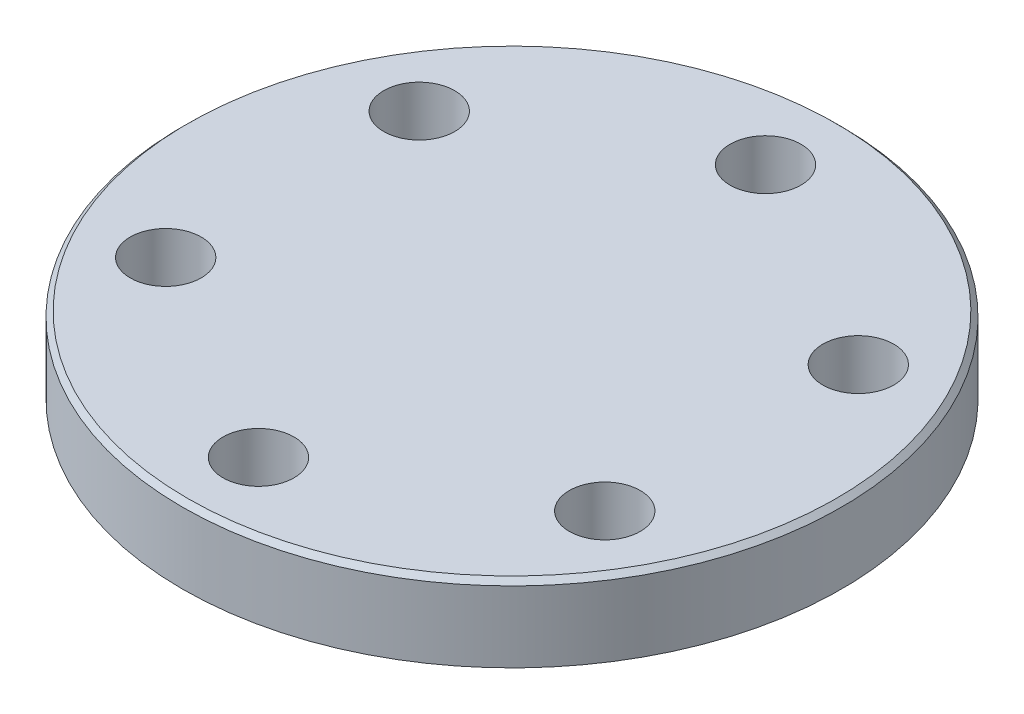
ISO-10303-21;
HEADER;
FILE_DESCRIPTION(('STEP AP214'),'2;1');
FILE_NAME('part.step','',(''),(''),'','','');
FILE_SCHEMA(('AUTOMOTIVE_DESIGN { 1 0 10303 214 1 1 1 1 }'));
ENDSEC;
DATA;
#1=APPLICATION_CONTEXT('core data for automotive mechanical design processes');
#2=APPLICATION_PROTOCOL_DEFINITION('international standard','automotive_design',2000,#1);
#3=PRODUCT_CONTEXT('',#1,'mechanical');
#4=PRODUCT('Part','Part','',(#3));
#5=PRODUCT_RELATED_PRODUCT_CATEGORY('part','',(#4));
#6=PRODUCT_DEFINITION_FORMATION('','',#4);
#7=PRODUCT_DEFINITION_CONTEXT('part definition',#1,'design');
#8=PRODUCT_DEFINITION('design','',#6,#7);
#9=PRODUCT_DEFINITION_SHAPE('','',#8);
#10=(LENGTH_UNIT() NAMED_UNIT(*) SI_UNIT(.MILLI.,.METRE.));
#11=(NAMED_UNIT(*) PLANE_ANGLE_UNIT() SI_UNIT($,.RADIAN.));
#12=(NAMED_UNIT(*) SI_UNIT($,.STERADIAN.) SOLID_ANGLE_UNIT());
#13=UNCERTAINTY_MEASURE_WITH_UNIT(LENGTH_MEASURE(1.E-05),#10,'distance_accuracy_value','');
#14=(GEOMETRIC_REPRESENTATION_CONTEXT(3) GLOBAL_UNCERTAINTY_ASSIGNED_CONTEXT((#13)) GLOBAL_UNIT_ASSIGNED_CONTEXT((#10,
#11,#12)) REPRESENTATION_CONTEXT('',''));
#15=CARTESIAN_POINT('',(0.,0.,0.));
#16=DIRECTION('',(0.,0.,1.));
#17=DIRECTION('',(1.,0.,0.));
#18=AXIS2_PLACEMENT_3D('',#15,#16,#17);
#19=CARTESIAN_POINT('',(1.56367974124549E-11,-775.6,0.));
#20=DIRECTION('',(0.,-1.,0.));
#21=DIRECTION('',(0.,0.,-0.999999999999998));
#22=AXIS2_PLACEMENT_3D('',#19,#20,#21);
#23=CYLINDRICAL_SURFACE('',#22,65.);
#24=CARTESIAN_POINT('',(1.5635062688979E-11,-831.,0.));
#25=DIRECTION('',(0.,1.,0.));
#26=DIRECTION('',(0.,0.,0.999999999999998));
#27=AXIS2_PLACEMENT_3D('',#24,#25,#26);
#28=CIRCLE('',#27,65.);
#29=CARTESIAN_POINT('',(1.5638670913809E-11,-831.,64.9999999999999));
#30=VERTEX_POINT('',#29);
#31=EDGE_CURVE('E53',#30,#30,#28,.F.);
#32=ORIENTED_EDGE('',*,*,#31,.T.);
#33=EDGE_LOOP('',(#32));
#34=FACE_BOUND('',#33,.T.);
#35=CARTESIAN_POINT('',(1.5632460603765E-11,-845.,0.));
#36=DIRECTION('',(0.,-1.,0.));
#37=DIRECTION('',(0.,0.,-0.999999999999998));
#38=AXIS2_PLACEMENT_3D('',#35,#36,#37);
#39=CIRCLE('',#38,65.);
#40=CARTESIAN_POINT('',(1.5628852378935E-11,-845.,-64.9999999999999));
#41=VERTEX_POINT('',#40);
#42=EDGE_CURVE('E57',#41,#41,#39,.T.);
#43=ORIENTED_EDGE('',*,*,#42,.F.);
#44=EDGE_LOOP('',(#43));
#45=FACE_BOUND('',#44,.T.);
#46=ADVANCED_FACE('F46',(#34,#45),#23,.T.);
#47=CARTESIAN_POINT('',(65.0000000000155,-844.999999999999,0.));
#48=DIRECTION('',(0.,-1.,0.));
#49=DIRECTION('',(0.,0.,-0.999999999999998));
#50=AXIS2_PLACEMENT_3D('',#47,#48,#49);
#51=PLANE('',#50);
#52=CARTESIAN_POINT('',(-43.3012701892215,-844.999999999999,-25.0000000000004));
#53=DIRECTION('',(0.,1.,0.));
#54=DIRECTION('',(0.866025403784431,0.,0.500000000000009));
#55=AXIS2_PLACEMENT_3D('',#52,#53,#54);
#56=CIRCLE('',#55,7.);
#57=CARTESIAN_POINT('',(-37.2390923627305,-844.999999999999,-21.5000000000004));
#58=VERTEX_POINT('',#57);
#59=EDGE_CURVE('E79',#58,#58,#56,.T.);
#60=ORIENTED_EDGE('',*,*,#59,.T.);
#61=EDGE_LOOP('',(#60));
#62=FACE_BOUND('',#61,.T.);
#63=CARTESIAN_POINT('',(-43.3012701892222,-845.,24.9999999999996));
#64=DIRECTION('',(0.,1.,0.));
#65=DIRECTION('',(0.866025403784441,0.,-0.499999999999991));
#66=AXIS2_PLACEMENT_3D('',#63,#64,#65);
#67=CIRCLE('',#66,7.);
#68=CARTESIAN_POINT('',(-37.2390923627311,-845.,21.4999999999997));
#69=VERTEX_POINT('',#68);
#70=EDGE_CURVE('E85',#69,#69,#67,.T.);
#71=ORIENTED_EDGE('',*,*,#70,.T.);
#72=EDGE_LOOP('',(#71));
#73=FACE_BOUND('',#72,.T.);
#74=CARTESIAN_POINT('',(0.,-845.,50.));
#75=DIRECTION('',(0.,1.,0.));
#76=DIRECTION('',(0.,0.,-0.999999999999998));
#77=AXIS2_PLACEMENT_3D('',#74,#75,#76);
#78=CIRCLE('',#77,7.);
#79=CARTESIAN_POINT('',(0.,-845.,43.));
#80=VERTEX_POINT('',#79);
#81=EDGE_CURVE('E91',#80,#80,#78,.T.);
#82=ORIENTED_EDGE('',*,*,#81,.T.);
#83=EDGE_LOOP('',(#82));
#84=FACE_BOUND('',#83,.T.);
#85=CARTESIAN_POINT('',(43.3012701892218,-845.000000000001,25.0000000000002));
#86=DIRECTION('',(0.,1.,0.));
#87=DIRECTION('',(-0.866025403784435,0.,-0.500000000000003));
#88=AXIS2_PLACEMENT_3D('',#85,#86,#87);
#89=CIRCLE('',#88,7.);
#90=CARTESIAN_POINT('',(37.2390923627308,-845.000000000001,21.5000000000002));
#91=VERTEX_POINT('',#90);
#92=EDGE_CURVE('E73',#91,#91,#89,.T.);
#93=ORIENTED_EDGE('',*,*,#92,.T.);
#94=EDGE_LOOP('',(#93));
#95=FACE_BOUND('',#94,.T.);
#96=CARTESIAN_POINT('',(43.3012701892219,-845.,-24.9999999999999));
#97=DIRECTION('',(0.,1.,0.));
#98=DIRECTION('',(-0.866025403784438,0.,0.499999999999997));
#99=AXIS2_PLACEMENT_3D('',#96,#97,#98);
#100=CIRCLE('',#99,7.);
#101=CARTESIAN_POINT('',(37.2390923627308,-845.,-21.4999999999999));
#102=VERTEX_POINT('',#101);
#103=EDGE_CURVE('E67',#102,#102,#100,.T.);
#104=ORIENTED_EDGE('',*,*,#103,.T.);
#105=EDGE_LOOP('',(#104));
#106=FACE_BOUND('',#105,.T.);
#107=CARTESIAN_POINT('',(0.,-845.,-49.9999999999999));
#108=DIRECTION('',(0.,1.,0.));
#109=DIRECTION('',(0.,0.,0.999999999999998));
#110=AXIS2_PLACEMENT_3D('',#107,#108,#109);
#111=CIRCLE('',#110,7.);
#112=CARTESIAN_POINT('',(0.,-845.,-42.9999999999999));
#113=VERTEX_POINT('',#112);
#114=EDGE_CURVE('E61',#113,#113,#111,.T.);
#115=ORIENTED_EDGE('',*,*,#114,.T.);
#116=EDGE_LOOP('',(#115));
#117=FACE_BOUND('',#116,.T.);
#118=ORIENTED_EDGE('',*,*,#42,.T.);
#119=EDGE_LOOP('',(#118));
#120=FACE_BOUND('',#119,.T.);
#121=ADVANCED_FACE('F100',(#62,#73,#84,#95,#106,#117,#120),#51,.T.);
#122=CARTESIAN_POINT('',(1.5635062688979E-11,-830.,0.));
#123=DIRECTION('',(0.,1.,0.));
#124=DIRECTION('',(0.,0.,0.999999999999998));
#125=AXIS2_PLACEMENT_3D('',#122,#123,#124);
#126=PLANE('',#125);
#127=CARTESIAN_POINT('',(-43.3012701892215,-829.999999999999,-25.0000000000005));
#128=DIRECTION('',(0.,1.,0.));
#129=DIRECTION('',(0.866025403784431,0.,0.500000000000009));
#130=AXIS2_PLACEMENT_3D('',#127,#128,#129);
#131=CIRCLE('',#130,7.);
#132=CARTESIAN_POINT('',(-37.2390923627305,-829.999999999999,-21.5000000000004));
#133=VERTEX_POINT('',#132);
#134=EDGE_CURVE('E76',#133,#133,#131,.T.);
#135=ORIENTED_EDGE('',*,*,#134,.F.);
#136=EDGE_LOOP('',(#135));
#137=FACE_BOUND('',#136,.T.);
#138=CARTESIAN_POINT('',(-43.3012701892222,-830.,24.9999999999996));
#139=DIRECTION('',(0.,1.,0.));
#140=DIRECTION('',(0.866025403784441,0.,-0.499999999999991));
#141=AXIS2_PLACEMENT_3D('',#138,#139,#140);
#142=CIRCLE('',#141,7.);
#143=CARTESIAN_POINT('',(-37.2390923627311,-830.,21.4999999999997));
#144=VERTEX_POINT('',#143);
#145=EDGE_CURVE('E82',#144,#144,#142,.T.);
#146=ORIENTED_EDGE('',*,*,#145,.F.);
#147=EDGE_LOOP('',(#146));
#148=FACE_BOUND('',#147,.T.);
#149=CARTESIAN_POINT('',(0.,-830.,50.));
#150=DIRECTION('',(0.,1.,0.));
#151=DIRECTION('',(0.,0.,-0.999999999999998));
#152=AXIS2_PLACEMENT_3D('',#149,#150,#151);
#153=CIRCLE('',#152,7.);
#154=CARTESIAN_POINT('',(0.,-830.,43.));
#155=VERTEX_POINT('',#154);
#156=EDGE_CURVE('E88',#155,#155,#153,.T.);
#157=ORIENTED_EDGE('',*,*,#156,.F.);
#158=EDGE_LOOP('',(#157));
#159=FACE_BOUND('',#158,.T.);
#160=CARTESIAN_POINT('',(43.3012701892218,-830.000000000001,25.0000000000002));
#161=DIRECTION('',(0.,1.,0.));
#162=DIRECTION('',(-0.866025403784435,0.,-0.500000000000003));
#163=AXIS2_PLACEMENT_3D('',#160,#161,#162);
#164=CIRCLE('',#163,7.);
#165=CARTESIAN_POINT('',(37.2390923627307,-830.000000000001,21.5000000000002));
#166=VERTEX_POINT('',#165);
#167=EDGE_CURVE('E94',#166,#166,#164,.T.);
#168=ORIENTED_EDGE('',*,*,#167,.F.);
#169=EDGE_LOOP('',(#168));
#170=FACE_BOUND('',#169,.T.);
#171=CARTESIAN_POINT('',(43.3012701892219,-830.,-24.9999999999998));
#172=DIRECTION('',(0.,1.,0.));
#173=DIRECTION('',(-0.866025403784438,0.,0.499999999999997));
#174=AXIS2_PLACEMENT_3D('',#171,#172,#173);
#175=CIRCLE('',#174,7.);
#176=CARTESIAN_POINT('',(37.2390923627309,-830.,-21.4999999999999));
#177=VERTEX_POINT('',#176);
#178=EDGE_CURVE('E70',#177,#177,#175,.T.);
#179=ORIENTED_EDGE('',*,*,#178,.F.);
#180=EDGE_LOOP('',(#179));
#181=FACE_BOUND('',#180,.T.);
#182=CARTESIAN_POINT('',(0.,-830.,-49.9999999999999));
#183=DIRECTION('',(0.,1.,0.));
#184=DIRECTION('',(0.,0.,0.999999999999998));
#185=AXIS2_PLACEMENT_3D('',#182,#183,#184);
#186=CIRCLE('',#185,7.);
#187=CARTESIAN_POINT('',(0.,-830.,-42.9999999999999));
#188=VERTEX_POINT('',#187);
#189=EDGE_CURVE('E64',#188,#188,#186,.T.);
#190=ORIENTED_EDGE('',*,*,#189,.F.);
#191=EDGE_LOOP('',(#190));
#192=FACE_BOUND('',#191,.T.);
#193=CARTESIAN_POINT('',(1.5635062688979E-11,-830.,0.));
#194=DIRECTION('',(0.,1.,0.));
#195=DIRECTION('',(0.,0.,0.999999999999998));
#196=AXIS2_PLACEMENT_3D('',#193,#194,#195);
#197=CIRCLE('',#196,64.);
#198=CARTESIAN_POINT('',(1.56386154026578E-11,-830.,63.9999999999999));
#199=VERTEX_POINT('',#198);
#200=EDGE_CURVE('E12',#199,#199,#197,.T.);
#201=ORIENTED_EDGE('',*,*,#200,.T.);
#202=EDGE_LOOP('',(#201));
#203=FACE_BOUND('',#202,.T.);
#204=ADVANCED_FACE('F111',(#137,#148,#159,#170,#181,#192,#203),#126,.T.);
#205=CARTESIAN_POINT('',(1.5635062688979E-11,-831.,0.));
#206=DIRECTION('',(0.,-1.,0.));
#207=DIRECTION('',(0.,0.,-0.999999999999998));
#208=AXIS2_PLACEMENT_3D('',#205,#206,#207);
#209=CONICAL_SURFACE('',#208,65.,0.785398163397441);
#210=ORIENTED_EDGE('',*,*,#200,.F.);
#211=EDGE_LOOP('',(#210));
#212=FACE_BOUND('',#211,.T.);
#213=ORIENTED_EDGE('',*,*,#31,.F.);
#214=EDGE_LOOP('',(#213));
#215=FACE_BOUND('',#214,.T.);
#216=ADVANCED_FACE('F48',(#212,#215),#209,.T.);
#217=CARTESIAN_POINT('',(0.,-845.,-49.9999999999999));
#218=DIRECTION('',(0.,1.,0.));
#219=DIRECTION('',(0.,0.,0.999999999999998));
#220=AXIS2_PLACEMENT_3D('',#217,#218,#219);
#221=CYLINDRICAL_SURFACE('',#220,7.);
#222=ORIENTED_EDGE('',*,*,#114,.F.);
#223=EDGE_LOOP('',(#222));
#224=FACE_BOUND('',#223,.T.);
#225=ORIENTED_EDGE('',*,*,#189,.T.);
#226=EDGE_LOOP('',(#225));
#227=FACE_BOUND('',#226,.T.);
#228=ADVANCED_FACE('F120',(#224,#227),#221,.F.);
#229=CARTESIAN_POINT('',(43.3012701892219,-845.,-24.9999999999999));
#230=DIRECTION('',(0.,1.,0.));
#231=DIRECTION('',(0.,0.,0.999999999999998));
#232=AXIS2_PLACEMENT_3D('',#229,#230,#231);
#233=CYLINDRICAL_SURFACE('',#232,7.);
#234=ORIENTED_EDGE('',*,*,#103,.F.);
#235=EDGE_LOOP('',(#234));
#236=FACE_BOUND('',#235,.T.);
#237=ORIENTED_EDGE('',*,*,#178,.T.);
#238=EDGE_LOOP('',(#237));
#239=FACE_BOUND('',#238,.T.);
#240=ADVANCED_FACE('F107',(#236,#239),#233,.F.);
#241=CARTESIAN_POINT('',(43.3012701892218,-845.000000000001,25.0000000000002));
#242=DIRECTION('',(0.,1.,0.));
#243=DIRECTION('',(0.,0.,0.999999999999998));
#244=AXIS2_PLACEMENT_3D('',#241,#242,#243);
#245=CYLINDRICAL_SURFACE('',#244,7.);
#246=ORIENTED_EDGE('',*,*,#92,.F.);
#247=EDGE_LOOP('',(#246));
#248=FACE_BOUND('',#247,.T.);
#249=ORIENTED_EDGE('',*,*,#167,.T.);
#250=EDGE_LOOP('',(#249));
#251=FACE_BOUND('',#250,.T.);
#252=ADVANCED_FACE('F103',(#248,#251),#245,.F.);
#253=CARTESIAN_POINT('',(0.,-845.,50.));
#254=DIRECTION('',(0.,1.,0.));
#255=DIRECTION('',(0.,0.,0.999999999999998));
#256=AXIS2_PLACEMENT_3D('',#253,#254,#255);
#257=CYLINDRICAL_SURFACE('',#256,7.);
#258=ORIENTED_EDGE('',*,*,#81,.F.);
#259=EDGE_LOOP('',(#258));
#260=FACE_BOUND('',#259,.T.);
#261=ORIENTED_EDGE('',*,*,#156,.T.);
#262=EDGE_LOOP('',(#261));
#263=FACE_BOUND('',#262,.T.);
#264=ADVANCED_FACE('F106',(#260,#263),#257,.F.);
#265=CARTESIAN_POINT('',(-43.3012701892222,-845.,24.9999999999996));
#266=DIRECTION('',(0.,1.,0.));
#267=DIRECTION('',(0.,0.,0.999999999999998));
#268=AXIS2_PLACEMENT_3D('',#265,#266,#267);
#269=CYLINDRICAL_SURFACE('',#268,7.);
#270=ORIENTED_EDGE('',*,*,#70,.F.);
#271=EDGE_LOOP('',(#270));
#272=FACE_BOUND('',#271,.T.);
#273=ORIENTED_EDGE('',*,*,#145,.T.);
#274=EDGE_LOOP('',(#273));
#275=FACE_BOUND('',#274,.T.);
#276=ADVANCED_FACE('F151',(#272,#275),#269,.F.);
#277=CARTESIAN_POINT('',(-43.3012701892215,-844.999999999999,-25.0000000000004));
#278=DIRECTION('',(0.,1.,0.));
#279=DIRECTION('',(0.,0.,0.999999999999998));
#280=AXIS2_PLACEMENT_3D('',#277,#278,#279);
#281=CYLINDRICAL_SURFACE('',#280,7.);
#282=ORIENTED_EDGE('',*,*,#59,.F.);
#283=EDGE_LOOP('',(#282));
#284=FACE_BOUND('',#283,.T.);
#285=ORIENTED_EDGE('',*,*,#134,.T.);
#286=EDGE_LOOP('',(#285));
#287=FACE_BOUND('',#286,.T.);
#288=ADVANCED_FACE('F158',(#284,#287),#281,.F.);
#289=CLOSED_SHELL('',(#46,#121,#204,#216,#228,#240,#252,#264,#276,#288));
#290=MANIFOLD_SOLID_BREP('B2',#289);
#291=ADVANCED_BREP_SHAPE_REPRESENTATION('',(#18,#290),#14);
#292=SHAPE_DEFINITION_REPRESENTATION(#9,#291);
ENDSEC;
END-ISO-10303-21;
